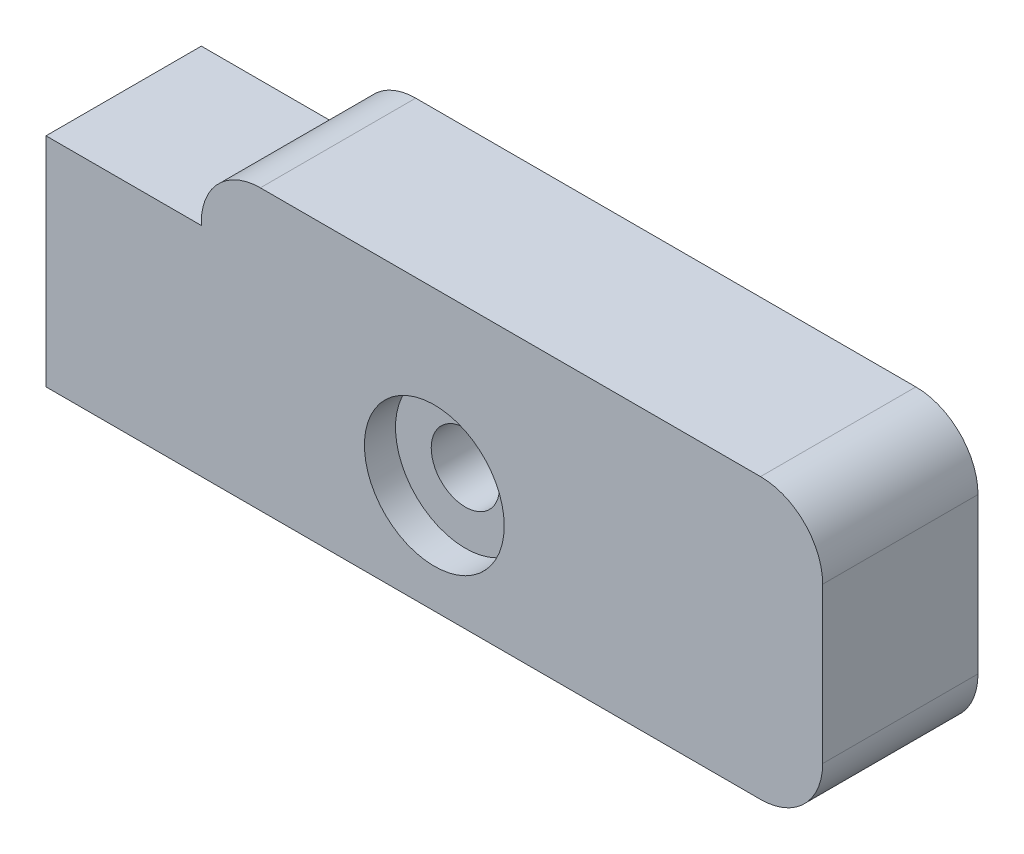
from build123d import *

# Parameters (mm, degrees)
BOSS_EXTRU_1_DEPTH      = 5
ESQUISSE2_R             = 3
ESQUISSE2_R_2           = 2.1
BOSS_EXTRU_2_DEPTH      = 2.5
ESQUISSE3_W             = 3
ESQUISSE3_H             = 5
ENL_V_MAT_EXTRU_1_DEPTH = 9
ESQUISSE4_R             = 1.1
ENL_V_MAT_EXTRU_2_DEPTH = 10
ESQUISSE5_R             = 2.25
ENL_V_MAT_EXTRU_3_DEPTH = 1


with BuildPart() as part:
    # Esquisse1 → Boss.-Extru.1 (new body)
    with BuildSketch(Plane.XY):
        with BuildLine():
            Line((0, 0), (0, 7))
            Line((0, 7), (5, 7))
            Line((5, 7), (5, 7.1))
            ThreePointArc((5, 7.1), (5.556497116, 8.443502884), (6.9, 9))
            Line((6.9, 9), (23, 9))
            ThreePointArc((23, 9), (24.414213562, 8.414213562), (25, 7))
            Line((25, 7), (25, 2))
            ThreePointArc((25, 2), (24.414213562, 0.585786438), (23, 0))
            Line((23, 0), (0, 0))
        make_face()
    extrude(amount=BOSS_EXTRU_1_DEPTH)

    # Esquisse2 → Boss.-Extru.2 (add)
    with BuildSketch(Plane(origin=(0, 0, 0), x_dir=(-1, 0, 0), z_dir=(0, 0, -1))):
        with Locations((-12.49961627, 3.5)):
            Circle(ESQUISSE2_R)
        with Locations((-12.49961627, 3.5)):
            Circle(ESQUISSE2_R_2, mode=Mode.SUBTRACT)
    extrude(amount=BOSS_EXTRU_2_DEPTH)

    # Esquisse3 → Enl_v. mat.-Extru.1 (cut)
    with BuildSketch(Plane.ZY):
        with Locations((2.5, 3.5)):
            Rectangle(ESQUISSE3_W, ESQUISSE3_H)
    extrude(amount=-ENL_V_MAT_EXTRU_1_DEPTH, mode=Mode.SUBTRACT)

    # Esquisse4 → Enl_v. mat.-Extru.2 (cut)
    with BuildSketch(Plane(origin=(0, 0, 0), x_dir=(-1, 0, 0), z_dir=(0, 0, -1))):
        with Locations((-12.49961627, 3.5)):
            Circle(ESQUISSE4_R)
    extrude(amount=-ENL_V_MAT_EXTRU_2_DEPTH, mode=Mode.SUBTRACT)

    # Esquisse5 → Enl_v. mat.-Extru.3 (cut)
    with BuildSketch(Plane.XY.offset(5)):
        with Locations((12.49961627, 3.5)):
            Circle(ESQUISSE5_R)
    extrude(amount=-ENL_V_MAT_EXTRU_3_DEPTH, mode=Mode.SUBTRACT)


solid = part.part
